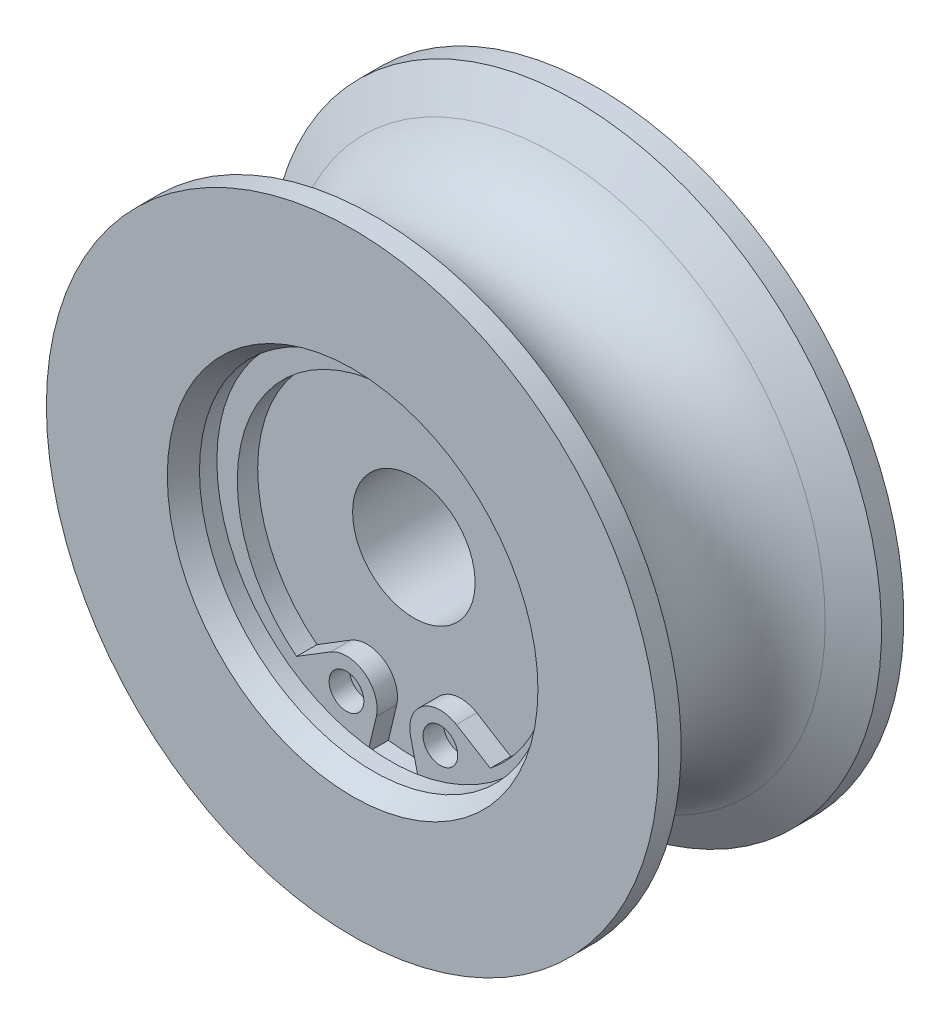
ISO-10303-21;
HEADER;
FILE_DESCRIPTION(('STEP AP214'),'2;1');
FILE_NAME('part.step','',(''),(''),'','','');
FILE_SCHEMA(('AUTOMOTIVE_DESIGN { 1 0 10303 214 1 1 1 1 }'));
ENDSEC;
DATA;
#1=APPLICATION_CONTEXT('core data for automotive mechanical design processes');
#2=APPLICATION_PROTOCOL_DEFINITION('international standard','automotive_design',2000,#1);
#3=PRODUCT_CONTEXT('',#1,'mechanical');
#4=PRODUCT('Part','Part','',(#3));
#5=PRODUCT_RELATED_PRODUCT_CATEGORY('part','',(#4));
#6=PRODUCT_DEFINITION_FORMATION('','',#4);
#7=PRODUCT_DEFINITION_CONTEXT('part definition',#1,'design');
#8=PRODUCT_DEFINITION('design','',#6,#7);
#9=PRODUCT_DEFINITION_SHAPE('','',#8);
#10=(LENGTH_UNIT() NAMED_UNIT(*) SI_UNIT(.MILLI.,.METRE.));
#11=(NAMED_UNIT(*) PLANE_ANGLE_UNIT() SI_UNIT($,.RADIAN.));
#12=(NAMED_UNIT(*) SI_UNIT($,.STERADIAN.) SOLID_ANGLE_UNIT());
#13=UNCERTAINTY_MEASURE_WITH_UNIT(LENGTH_MEASURE(1.E-05),#10,'distance_accuracy_value','');
#14=(GEOMETRIC_REPRESENTATION_CONTEXT(3) GLOBAL_UNCERTAINTY_ASSIGNED_CONTEXT((#13)) GLOBAL_UNIT_ASSIGNED_CONTEXT((#10,
#11,#12)) REPRESENTATION_CONTEXT('',''));
#15=CARTESIAN_POINT('',(0.,0.,0.));
#16=DIRECTION('',(0.,0.,1.));
#17=DIRECTION('',(1.,0.,0.));
#18=AXIS2_PLACEMENT_3D('',#15,#16,#17);
#19=CARTESIAN_POINT('',(0.,-0.5,4.));
#20=DIRECTION('',(0.,0.,1.));
#21=DIRECTION('',(-1.,0.,0.));
#22=AXIS2_PLACEMENT_3D('',#19,#20,#21);
#23=CYLINDRICAL_SURFACE('',#22,7.65);
#24=CARTESIAN_POINT('',(0.,-0.5,3.));
#25=DIRECTION('',(0.,0.,1.));
#26=DIRECTION('',(1.,0.,0.));
#27=AXIS2_PLACEMENT_3D('',#24,#25,#26);
#28=CIRCLE('',#27,7.65);
#29=CARTESIAN_POINT('',(4.745138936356,-6.50051301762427,3.));
#30=VERTEX_POINT('',#29);
#31=CARTESIAN_POINT('',(-4.74513893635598,-6.50051301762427,3.));
#32=VERTEX_POINT('',#31);
#33=EDGE_CURVE('E180',#30,#32,#28,.T.);
#34=ORIENTED_EDGE('',*,*,#33,.F.);
#35=DIRECTION('',(0.,0.,-1.));
#36=VECTOR('',#35,1.);
#37=CARTESIAN_POINT('',(4.74513893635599,-6.50051301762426,4.));
#38=LINE('',#37,#36);
#39=CARTESIAN_POINT('',(4.74513893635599,-6.50051301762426,4.));
#40=VERTEX_POINT('',#39);
#41=EDGE_CURVE('E140',#40,#30,#38,.T.);
#42=ORIENTED_EDGE('',*,*,#41,.F.);
#43=CARTESIAN_POINT('',(0.,-0.5,4.));
#44=DIRECTION('',(0.,0.,-1.));
#45=DIRECTION('',(0.,-1.,0.));
#46=AXIS2_PLACEMENT_3D('',#43,#44,#45);
#47=CIRCLE('',#46,7.65);
#48=CARTESIAN_POINT('',(-4.74513893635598,-6.50051301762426,4.));
#49=VERTEX_POINT('',#48);
#50=EDGE_CURVE('E133',#49,#40,#47,.T.);
#51=ORIENTED_EDGE('',*,*,#50,.F.);
#52=DIRECTION('',(0.,0.,-1.));
#53=VECTOR('',#52,1.);
#54=CARTESIAN_POINT('',(-4.74513893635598,-6.50051301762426,4.));
#55=LINE('',#54,#53);
#56=EDGE_CURVE('E135',#49,#32,#55,.T.);
#57=ORIENTED_EDGE('',*,*,#56,.T.);
#58=EDGE_LOOP('',(#34,#42,#51,#57));
#59=FACE_BOUND('',#58,.T.);
#60=ADVANCED_FACE('F14',(#59),#23,.F.);
#61=CARTESIAN_POINT('',(3.08650226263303,-5.47917588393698,4.));
#62=DIRECTION('',(-0.524334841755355,-0.851512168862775,0.));
#63=DIRECTION('',(-0.851512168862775,0.524334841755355,0.));
#64=AXIS2_PLACEMENT_3D('',#61,#62,#63);
#65=PLANE('',#64);
#66=DIRECTION('',(0.851512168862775,-0.524334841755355,0.));
#67=VECTOR('',#66,1.);
#68=CARTESIAN_POINT('',(-2.93719834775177,-1.76996746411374,3.));
#69=LINE('',#68,#67);
#70=CARTESIAN_POINT('',(3.08650226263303,-5.47917588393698,3.));
#71=VERTEX_POINT('',#70);
#72=EDGE_CURVE('E104',#71,#30,#69,.T.);
#73=ORIENTED_EDGE('',*,*,#72,.F.);
#74=DIRECTION('',(0.,0.,-1.));
#75=VECTOR('',#74,1.);
#76=CARTESIAN_POINT('',(3.08650226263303,-5.47917588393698,4.));
#77=LINE('',#76,#75);
#78=CARTESIAN_POINT('',(3.08650226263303,-5.47917588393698,4.));
#79=VERTEX_POINT('',#78);
#80=EDGE_CURVE('E100',#79,#71,#77,.T.);
#81=ORIENTED_EDGE('',*,*,#80,.F.);
#82=DIRECTION('',(-0.851512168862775,0.524334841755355,0.));
#83=VECTOR('',#82,1.);
#84=CARTESIAN_POINT('',(3.08650226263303,-5.47917588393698,4.));
#85=LINE('',#84,#83);
#86=EDGE_CURVE('E129',#40,#79,#85,.T.);
#87=ORIENTED_EDGE('',*,*,#86,.F.);
#88=ORIENTED_EDGE('',*,*,#41,.T.);
#89=EDGE_LOOP('',(#73,#81,#87,#88));
#90=FACE_BOUND('',#89,.T.);
#91=ADVANCED_FACE('F176',(#90),#65,.F.);
#92=CARTESIAN_POINT('',(2.3,-6.75644413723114,4.));
#93=DIRECTION('',(0.,0.,1.));
#94=DIRECTION('',(-1.,0.,0.));
#95=AXIS2_PLACEMENT_3D('',#92,#93,#94);
#96=CYLINDRICAL_SURFACE('',#95,1.5);
#97=CARTESIAN_POINT('',(2.3,-6.75644413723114,3.));
#98=DIRECTION('',(0.,0.,1.));
#99=DIRECTION('',(1.,0.,0.));
#100=AXIS2_PLACEMENT_3D('',#97,#98,#99);
#101=CIRCLE('',#100,1.5);
#102=CARTESIAN_POINT('',(0.840693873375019,-7.10346809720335,3.));
#103=VERTEX_POINT('',#102);
#104=EDGE_CURVE('E96',#71,#103,#101,.T.);
#105=ORIENTED_EDGE('',*,*,#104,.T.);
#106=DIRECTION('',(0.,0.,-1.));
#107=VECTOR('',#106,1.);
#108=CARTESIAN_POINT('',(0.840693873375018,-7.10346809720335,4.));
#109=LINE('',#108,#107);
#110=CARTESIAN_POINT('',(0.840693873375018,-7.10346809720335,4.));
#111=VERTEX_POINT('',#110);
#112=EDGE_CURVE('E98',#111,#103,#109,.T.);
#113=ORIENTED_EDGE('',*,*,#112,.F.);
#114=CARTESIAN_POINT('',(2.3,-6.75644413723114,4.));
#115=DIRECTION('',(0.,0.,1.));
#116=DIRECTION('',(1.,0.,0.));
#117=AXIS2_PLACEMENT_3D('',#114,#115,#116);
#118=CIRCLE('',#117,1.5);
#119=EDGE_CURVE('E134',#79,#111,#118,.T.);
#120=ORIENTED_EDGE('',*,*,#119,.F.);
#121=ORIENTED_EDGE('',*,*,#80,.T.);
#122=EDGE_LOOP('',(#105,#113,#120,#121));
#123=FACE_BOUND('',#122,.T.);
#124=ADVANCED_FACE('F16',(#123),#96,.T.);
#125=CARTESIAN_POINT('',(-0.84069387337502,-7.10346809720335,4.));
#126=DIRECTION('',(-0.97287075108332,0.231349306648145,0.));
#127=DIRECTION('',(0.,0.,1.));
#128=AXIS2_PLACEMENT_3D('',#125,#126,#127);
#129=PLANE('',#128);
#130=DIRECTION('',(0.,0.,-1.));
#131=VECTOR('',#130,1.);
#132=CARTESIAN_POINT('',(-1.24703201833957,-8.81220240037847,-6.));
#133=LINE('',#132,#131);
#134=CARTESIAN_POINT('',(-1.24703201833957,-8.81220240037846,3.));
#135=VERTEX_POINT('',#134);
#136=CARTESIAN_POINT('',(-1.24703201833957,-8.81220240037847,4.));
#137=VERTEX_POINT('',#136);
#138=EDGE_CURVE('E110',#135,#137,#133,.F.);
#139=ORIENTED_EDGE('',*,*,#138,.F.);
#140=DIRECTION('',(-0.231349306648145,-0.97287075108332,0.));
#141=VECTOR('',#140,1.);
#142=CARTESIAN_POINT('',(1.4783197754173,2.64845458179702,3.));
#143=LINE('',#142,#141);
#144=CARTESIAN_POINT('',(-0.840693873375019,-7.10346809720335,3.));
#145=VERTEX_POINT('',#144);
#146=EDGE_CURVE('E189',#145,#135,#143,.T.);
#147=ORIENTED_EDGE('',*,*,#146,.F.);
#148=DIRECTION('',(0.,0.,-1.));
#149=VECTOR('',#148,1.);
#150=CARTESIAN_POINT('',(-0.84069387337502,-7.10346809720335,4.));
#151=LINE('',#150,#149);
#152=CARTESIAN_POINT('',(-0.84069387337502,-7.10346809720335,4.));
#153=VERTEX_POINT('',#152);
#154=EDGE_CURVE('E117',#153,#145,#151,.T.);
#155=ORIENTED_EDGE('',*,*,#154,.F.);
#156=DIRECTION('',(0.231349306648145,0.97287075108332,0.));
#157=VECTOR('',#156,1.);
#158=CARTESIAN_POINT('',(-0.84069387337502,-7.10346809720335,4.));
#159=LINE('',#158,#157);
#160=EDGE_CURVE('E157',#137,#153,#159,.T.);
#161=ORIENTED_EDGE('',*,*,#160,.F.);
#162=EDGE_LOOP('',(#139,#147,#155,#161));
#163=FACE_BOUND('',#162,.T.);
#164=ADVANCED_FACE('F296',(#163),#129,.F.);
#165=CARTESIAN_POINT('',(0.,-0.5,4.));
#166=DIRECTION('',(0.,0.,-1.));
#167=DIRECTION('',(0.,-1.,0.));
#168=AXIS2_PLACEMENT_3D('',#165,#166,#167);
#169=PLANE('',#168);
#170=CARTESIAN_POINT('',(2.3,-6.75644413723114,4.));
#171=DIRECTION('',(0.,0.,1.));
#172=DIRECTION('',(1.,0.,0.));
#173=AXIS2_PLACEMENT_3D('',#170,#171,#172);
#174=CIRCLE('',#173,0.85);
#175=CARTESIAN_POINT('',(3.15,-6.75644413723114,4.));
#176=VERTEX_POINT('',#175);
#177=EDGE_CURVE('E125',#176,#176,#174,.T.);
#178=ORIENTED_EDGE('',*,*,#177,.F.);
#179=EDGE_LOOP('',(#178));
#180=FACE_BOUND('',#179,.T.);
#181=CARTESIAN_POINT('',(-2.3,-6.75644413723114,4.));
#182=DIRECTION('',(0.,0.,-1.));
#183=DIRECTION('',(1.,0.,0.));
#184=AXIS2_PLACEMENT_3D('',#181,#182,#183);
#185=CIRCLE('',#184,0.85);
#186=CARTESIAN_POINT('',(-1.45,-6.75644413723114,4.));
#187=VERTEX_POINT('',#186);
#188=EDGE_CURVE('E122',#187,#187,#185,.T.);
#189=ORIENTED_EDGE('',*,*,#188,.T.);
#190=EDGE_LOOP('',(#189));
#191=FACE_BOUND('',#190,.T.);
#192=CARTESIAN_POINT('',(0.,0.,4.));
#193=DIRECTION('',(0.,0.,-1.));
#194=DIRECTION('',(-1.,0.,0.));
#195=AXIS2_PLACEMENT_3D('',#192,#193,#194);
#196=CIRCLE('',#195,8.9);
#197=CARTESIAN_POINT('',(1.24703201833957,-8.81220240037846,4.));
#198=VERTEX_POINT('',#197);
#199=EDGE_CURVE('E23',#137,#198,#196,.T.);
#200=ORIENTED_EDGE('',*,*,#199,.F.);
#201=ORIENTED_EDGE('',*,*,#160,.T.);
#202=CARTESIAN_POINT('',(-2.3,-6.75644413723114,4.));
#203=DIRECTION('',(0.,0.,1.));
#204=DIRECTION('',(-1.,0.,0.));
#205=AXIS2_PLACEMENT_3D('',#202,#203,#204);
#206=CIRCLE('',#205,1.5);
#207=CARTESIAN_POINT('',(-3.08650226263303,-5.47917588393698,4.));
#208=VERTEX_POINT('',#207);
#209=EDGE_CURVE('E146',#153,#208,#206,.T.);
#210=ORIENTED_EDGE('',*,*,#209,.T.);
#211=DIRECTION('',(-0.851512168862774,-0.524334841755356,0.));
#212=VECTOR('',#211,1.);
#213=CARTESIAN_POINT('',(-3.08650226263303,-5.47917588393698,4.));
#214=LINE('',#213,#212);
#215=EDGE_CURVE('E59',#208,#49,#214,.T.);
#216=ORIENTED_EDGE('',*,*,#215,.T.);
#217=ORIENTED_EDGE('',*,*,#50,.T.);
#218=ORIENTED_EDGE('',*,*,#86,.T.);
#219=ORIENTED_EDGE('',*,*,#119,.T.);
#220=DIRECTION('',(0.231349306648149,-0.972870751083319,0.));
#221=VECTOR('',#220,1.);
#222=CARTESIAN_POINT('',(0.840693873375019,-7.10346809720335,4.));
#223=LINE('',#222,#221);
#224=EDGE_CURVE('E114',#111,#198,#223,.T.);
#225=ORIENTED_EDGE('',*,*,#224,.T.);
#226=EDGE_LOOP('',(#200,#201,#210,#216,#217,#218,#219,#225));
#227=FACE_BOUND('',#226,.T.);
#228=ADVANCED_FACE('F171',(#180,#191,#227),#169,.F.);
#229=CARTESIAN_POINT('',(2.3,-6.75644413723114,4.));
#230=DIRECTION('',(0.,0.,1.));
#231=DIRECTION('',(-1.,0.,0.));
#232=AXIS2_PLACEMENT_3D('',#229,#230,#231);
#233=CYLINDRICAL_SURFACE('',#232,0.85);
#234=CARTESIAN_POINT('',(2.3,-6.75644413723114,3.));
#235=DIRECTION('',(0.,0.,1.));
#236=DIRECTION('',(1.,0.,0.));
#237=AXIS2_PLACEMENT_3D('',#234,#235,#236);
#238=CIRCLE('',#237,0.85);
#239=CARTESIAN_POINT('',(3.15,-6.75644413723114,3.));
#240=VERTEX_POINT('',#239);
#241=EDGE_CURVE('E199',#240,#240,#238,.T.);
#242=ORIENTED_EDGE('',*,*,#241,.F.);
#243=EDGE_LOOP('',(#242));
#244=FACE_BOUND('',#243,.T.);
#245=ORIENTED_EDGE('',*,*,#177,.T.);
#246=EDGE_LOOP('',(#245));
#247=FACE_BOUND('',#246,.T.);
#248=ADVANCED_FACE('F295',(#244,#247),#233,.F.);
#249=CARTESIAN_POINT('',(-2.3,-6.75644413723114,4.));
#250=DIRECTION('',(0.,0.,1.));
#251=DIRECTION('',(-1.,0.,0.));
#252=AXIS2_PLACEMENT_3D('',#249,#250,#251);
#253=CYLINDRICAL_SURFACE('',#252,0.85);
#254=CARTESIAN_POINT('',(-2.3,-6.75644413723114,3.));
#255=DIRECTION('',(0.,0.,1.));
#256=DIRECTION('',(1.,0.,0.));
#257=AXIS2_PLACEMENT_3D('',#254,#255,#256);
#258=CIRCLE('',#257,0.85);
#259=CARTESIAN_POINT('',(-1.45,-6.75644413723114,3.));
#260=VERTEX_POINT('',#259);
#261=EDGE_CURVE('E195',#260,#260,#258,.T.);
#262=ORIENTED_EDGE('',*,*,#261,.F.);
#263=EDGE_LOOP('',(#262));
#264=FACE_BOUND('',#263,.T.);
#265=ORIENTED_EDGE('',*,*,#188,.F.);
#266=EDGE_LOOP('',(#265));
#267=FACE_BOUND('',#266,.T.);
#268=ADVANCED_FACE('F302',(#264,#267),#253,.F.);
#269=CARTESIAN_POINT('',(-3.08650226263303,-5.47917588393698,4.));
#270=DIRECTION('',(0.524334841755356,-0.851512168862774,0.));
#271=DIRECTION('',(0.,0.,-1.));
#272=AXIS2_PLACEMENT_3D('',#269,#270,#271);
#273=PLANE('',#272);
#274=DIRECTION('',(0.851512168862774,0.524334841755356,0.));
#275=VECTOR('',#274,1.);
#276=CARTESIAN_POINT('',(2.93719834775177,-1.76996746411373,3.));
#277=LINE('',#276,#275);
#278=CARTESIAN_POINT('',(-3.08650226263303,-5.47917588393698,3.));
#279=VERTEX_POINT('',#278);
#280=EDGE_CURVE('E184',#32,#279,#277,.T.);
#281=ORIENTED_EDGE('',*,*,#280,.F.);
#282=ORIENTED_EDGE('',*,*,#56,.F.);
#283=ORIENTED_EDGE('',*,*,#215,.F.);
#284=DIRECTION('',(0.,0.,-1.));
#285=VECTOR('',#284,1.);
#286=CARTESIAN_POINT('',(-3.08650226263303,-5.47917588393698,4.));
#287=LINE('',#286,#285);
#288=EDGE_CURVE('E139',#208,#279,#287,.T.);
#289=ORIENTED_EDGE('',*,*,#288,.T.);
#290=EDGE_LOOP('',(#281,#282,#283,#289));
#291=FACE_BOUND('',#290,.T.);
#292=ADVANCED_FACE('F292',(#291),#273,.F.);
#293=CARTESIAN_POINT('',(-2.3,-6.75644413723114,4.));
#294=DIRECTION('',(0.,0.,1.));
#295=DIRECTION('',(-1.,0.,0.));
#296=AXIS2_PLACEMENT_3D('',#293,#294,#295);
#297=CYLINDRICAL_SURFACE('',#296,1.5);
#298=CARTESIAN_POINT('',(-2.3,-6.75644413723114,3.));
#299=DIRECTION('',(0.,0.,1.));
#300=DIRECTION('',(1.,0.,0.));
#301=AXIS2_PLACEMENT_3D('',#298,#299,#300);
#302=CIRCLE('',#301,1.5);
#303=EDGE_CURVE('E191',#145,#279,#302,.T.);
#304=ORIENTED_EDGE('',*,*,#303,.T.);
#305=ORIENTED_EDGE('',*,*,#288,.F.);
#306=ORIENTED_EDGE('',*,*,#209,.F.);
#307=ORIENTED_EDGE('',*,*,#154,.T.);
#308=EDGE_LOOP('',(#304,#305,#306,#307));
#309=FACE_BOUND('',#308,.T.);
#310=ADVANCED_FACE('F278',(#309),#297,.T.);
#311=CARTESIAN_POINT('',(0.840693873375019,-7.10346809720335,4.));
#312=DIRECTION('',(0.972870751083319,0.231349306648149,0.));
#313=DIRECTION('',(0.,0.,-1.));
#314=AXIS2_PLACEMENT_3D('',#311,#312,#313);
#315=PLANE('',#314);
#316=DIRECTION('',(0.,0.,-1.));
#317=VECTOR('',#316,1.);
#318=CARTESIAN_POINT('',(1.24703201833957,-8.81220240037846,-6.));
#319=LINE('',#318,#317);
#320=CARTESIAN_POINT('',(1.24703201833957,-8.81220240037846,3.));
#321=VERTEX_POINT('',#320);
#322=EDGE_CURVE('E9',#198,#321,#319,.T.);
#323=ORIENTED_EDGE('',*,*,#322,.F.);
#324=ORIENTED_EDGE('',*,*,#224,.F.);
#325=ORIENTED_EDGE('',*,*,#112,.T.);
#326=DIRECTION('',(-0.231349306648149,0.972870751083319,0.));
#327=VECTOR('',#326,1.);
#328=CARTESIAN_POINT('',(-1.47831977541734,2.648454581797,3.));
#329=LINE('',#328,#327);
#330=EDGE_CURVE('E65',#321,#103,#329,.T.);
#331=ORIENTED_EDGE('',*,*,#330,.F.);
#332=EDGE_LOOP('',(#323,#324,#325,#331));
#333=FACE_BOUND('',#332,.T.);
#334=ADVANCED_FACE('F112',(#333),#315,.F.);
#335=CARTESIAN_POINT('',(0.,3.,3.));
#336=DIRECTION('',(0.,0.,1.));
#337=DIRECTION('',(1.,0.,0.));
#338=AXIS2_PLACEMENT_3D('',#335,#336,#337);
#339=PLANE('',#338);
#340=ORIENTED_EDGE('',*,*,#241,.T.);
#341=EDGE_LOOP('',(#340));
#342=FACE_BOUND('',#341,.T.);
#343=ADVANCED_FACE('F267',(#342),#339,.T.);
#344=ORIENTED_EDGE('',*,*,#261,.T.);
#345=EDGE_LOOP('',(#344));
#346=FACE_BOUND('',#345,.T.);
#347=ADVANCED_FACE('F269',(#346),#339,.T.);
#348=CARTESIAN_POINT('',(0.,0.,0.));
#349=DIRECTION('',(0.,0.,-1.));
#350=DIRECTION('',(-1.,0.,0.));
#351=AXIS2_PLACEMENT_3D('',#348,#349,#350);
#352=TOROIDAL_SURFACE('',#351,15.5,4.5);
#353=CARTESIAN_POINT('',(0.,0.,3.89711431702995));
#354=DIRECTION('',(0.,0.,-1.));
#355=DIRECTION('',(-1.,0.,0.));
#356=AXIS2_PLACEMENT_3D('',#353,#354,#355);
#357=CIRCLE('',#356,13.25);
#358=CARTESIAN_POINT('',(-13.25,0.,3.89711431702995));
#359=VERTEX_POINT('',#358);
#360=EDGE_CURVE('E209',#359,#359,#357,.T.);
#361=ORIENTED_EDGE('',*,*,#360,.T.);
#362=EDGE_LOOP('',(#361));
#363=FACE_BOUND('',#362,.T.);
#364=CARTESIAN_POINT('',(0.,0.,-3.89711431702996));
#365=DIRECTION('',(0.,0.,-1.));
#366=DIRECTION('',(-1.,0.,0.));
#367=AXIS2_PLACEMENT_3D('',#364,#365,#366);
#368=CIRCLE('',#367,13.25);
#369=CARTESIAN_POINT('',(-13.25,0.,-3.89711431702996));
#370=VERTEX_POINT('',#369);
#371=EDGE_CURVE('E206',#370,#370,#368,.T.);
#372=ORIENTED_EDGE('',*,*,#371,.F.);
#373=EDGE_LOOP('',(#372));
#374=FACE_BOUND('',#373,.T.);
#375=ADVANCED_FACE('F276',(#363,#374),#352,.F.);
#376=CARTESIAN_POINT('',(0.,0.,3.89711431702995));
#377=DIRECTION('',(0.,0.,1.));
#378=DIRECTION('',(1.,0.,0.));
#379=AXIS2_PLACEMENT_3D('',#376,#377,#378);
#380=CONICAL_SURFACE('',#379,13.25,1.04719755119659);
#381=CARTESIAN_POINT('',(0.,0.,4.90747728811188));
#382=DIRECTION('',(0.,0.,-1.));
#383=DIRECTION('',(-1.,0.,0.));
#384=AXIS2_PLACEMENT_3D('',#381,#382,#383);
#385=CIRCLE('',#384,15.);
#386=CARTESIAN_POINT('',(-15.,0.,4.90747728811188));
#387=VERTEX_POINT('',#386);
#388=EDGE_CURVE('E212',#387,#387,#385,.T.);
#389=ORIENTED_EDGE('',*,*,#388,.T.);
#390=EDGE_LOOP('',(#389));
#391=FACE_BOUND('',#390,.T.);
#392=ORIENTED_EDGE('',*,*,#360,.F.);
#393=EDGE_LOOP('',(#392));
#394=FACE_BOUND('',#393,.T.);
#395=ADVANCED_FACE('F364',(#391,#394),#380,.T.);
#396=CARTESIAN_POINT('',(0.,0.,-4.90747728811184));
#397=DIRECTION('',(0.,0.,-1.));
#398=DIRECTION('',(-1.,0.,0.));
#399=AXIS2_PLACEMENT_3D('',#396,#397,#398);
#400=CONICAL_SURFACE('',#399,15.,1.04719755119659);
#401=ORIENTED_EDGE('',*,*,#371,.T.);
#402=EDGE_LOOP('',(#401));
#403=FACE_BOUND('',#402,.T.);
#404=CARTESIAN_POINT('',(0.,0.,-4.90747728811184));
#405=DIRECTION('',(0.,0.,-1.));
#406=DIRECTION('',(-1.,0.,0.));
#407=AXIS2_PLACEMENT_3D('',#404,#405,#406);
#408=CIRCLE('',#407,15.);
#409=CARTESIAN_POINT('',(-15.,0.,-4.90747728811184));
#410=VERTEX_POINT('',#409);
#411=EDGE_CURVE('E203',#410,#410,#408,.T.);
#412=ORIENTED_EDGE('',*,*,#411,.F.);
#413=EDGE_LOOP('',(#412));
#414=FACE_BOUND('',#413,.T.);
#415=ADVANCED_FACE('F262',(#403,#414),#400,.T.);
#416=CARTESIAN_POINT('',(0.,0.,-6.));
#417=DIRECTION('',(0.,0.,-1.));
#418=DIRECTION('',(-1.,0.,0.));
#419=AXIS2_PLACEMENT_3D('',#416,#417,#418);
#420=CYLINDRICAL_SURFACE('',#419,15.);
#421=CARTESIAN_POINT('',(0.,0.,6.));
#422=DIRECTION('',(0.,0.,-1.));
#423=DIRECTION('',(-1.,0.,0.));
#424=AXIS2_PLACEMENT_3D('',#421,#422,#423);
#425=CIRCLE('',#424,15.);
#426=CARTESIAN_POINT('',(-15.,0.,6.));
#427=VERTEX_POINT('',#426);
#428=EDGE_CURVE('E215',#427,#427,#425,.T.);
#429=ORIENTED_EDGE('',*,*,#428,.T.);
#430=EDGE_LOOP('',(#429));
#431=FACE_BOUND('',#430,.T.);
#432=ORIENTED_EDGE('',*,*,#388,.F.);
#433=EDGE_LOOP('',(#432));
#434=FACE_BOUND('',#433,.T.);
#435=ADVANCED_FACE('F252',(#431,#434),#420,.T.);
#436=CARTESIAN_POINT('',(0.,0.,-6.));
#437=DIRECTION('',(0.,0.,-1.));
#438=DIRECTION('',(-1.,0.,0.));
#439=AXIS2_PLACEMENT_3D('',#436,#437,#438);
#440=CYLINDRICAL_SURFACE('',#439,15.);
#441=ORIENTED_EDGE('',*,*,#411,.T.);
#442=EDGE_LOOP('',(#441));
#443=FACE_BOUND('',#442,.T.);
#444=CARTESIAN_POINT('',(0.,0.,-6.));
#445=DIRECTION('',(0.,0.,-1.));
#446=DIRECTION('',(-1.,0.,0.));
#447=AXIS2_PLACEMENT_3D('',#444,#445,#446);
#448=CIRCLE('',#447,15.);
#449=CARTESIAN_POINT('',(-15.,0.,-6.));
#450=VERTEX_POINT('',#449);
#451=EDGE_CURVE('E151',#450,#450,#448,.T.);
#452=ORIENTED_EDGE('',*,*,#451,.F.);
#453=EDGE_LOOP('',(#452));
#454=FACE_BOUND('',#453,.T.);
#455=ADVANCED_FACE('F249',(#443,#454),#440,.T.);
#456=CARTESIAN_POINT('',(0.,15.,6.));
#457=DIRECTION('',(0.,0.,1.));
#458=DIRECTION('',(1.,0.,0.));
#459=AXIS2_PLACEMENT_3D('',#456,#457,#458);
#460=PLANE('',#459);
#461=CARTESIAN_POINT('',(0.,0.,6.));
#462=DIRECTION('',(0.,0.,-1.));
#463=DIRECTION('',(-1.,0.,0.));
#464=AXIS2_PLACEMENT_3D('',#461,#462,#463);
#465=CIRCLE('',#464,9.07735026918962);
#466=CARTESIAN_POINT('',(-9.07735026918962,0.,6.));
#467=VERTEX_POINT('',#466);
#468=EDGE_CURVE('E218',#467,#467,#465,.T.);
#469=ORIENTED_EDGE('',*,*,#468,.T.);
#470=EDGE_LOOP('',(#469));
#471=FACE_BOUND('',#470,.T.);
#472=ORIENTED_EDGE('',*,*,#428,.F.);
#473=EDGE_LOOP('',(#472));
#474=FACE_BOUND('',#473,.T.);
#475=ADVANCED_FACE('F251',(#471,#474),#460,.T.);
#476=CARTESIAN_POINT('',(0.,6.5,-6.));
#477=DIRECTION('',(0.,0.,-1.));
#478=DIRECTION('',(-1.,0.,0.));
#479=AXIS2_PLACEMENT_3D('',#476,#477,#478);
#480=PLANE('',#479);
#481=ORIENTED_EDGE('',*,*,#451,.T.);
#482=EDGE_LOOP('',(#481));
#483=FACE_BOUND('',#482,.T.);
#484=CARTESIAN_POINT('',(0.,0.,-6.));
#485=DIRECTION('',(0.,0.,-1.));
#486=DIRECTION('',(-1.,0.,0.));
#487=AXIS2_PLACEMENT_3D('',#484,#485,#486);
#488=CIRCLE('',#487,6.5);
#489=CARTESIAN_POINT('',(-6.5,0.,-6.));
#490=VERTEX_POINT('',#489);
#491=EDGE_CURVE('E240',#490,#490,#488,.T.);
#492=ORIENTED_EDGE('',*,*,#491,.F.);
#493=EDGE_LOOP('',(#492));
#494=FACE_BOUND('',#493,.T.);
#495=ADVANCED_FACE('F246',(#483,#494),#480,.T.);
#496=CARTESIAN_POINT('',(0.,0.,6.));
#497=DIRECTION('',(0.,0.,1.));
#498=DIRECTION('',(1.,0.,0.));
#499=AXIS2_PLACEMENT_3D('',#496,#497,#498);
#500=CONICAL_SURFACE('',#499,9.07735026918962,0.523598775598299);
#501=CARTESIAN_POINT('',(0.,0.,5.));
#502=DIRECTION('',(0.,0.,-1.));
#503=DIRECTION('',(-1.,0.,0.));
#504=AXIS2_PLACEMENT_3D('',#501,#502,#503);
#505=CIRCLE('',#504,8.5);
#506=CARTESIAN_POINT('',(-8.5,0.,5.));
#507=VERTEX_POINT('',#506);
#508=EDGE_CURVE('E221',#507,#507,#505,.T.);
#509=ORIENTED_EDGE('',*,*,#508,.T.);
#510=EDGE_LOOP('',(#509));
#511=FACE_BOUND('',#510,.T.);
#512=ORIENTED_EDGE('',*,*,#468,.F.);
#513=EDGE_LOOP('',(#512));
#514=FACE_BOUND('',#513,.T.);
#515=ADVANCED_FACE('F407',(#511,#514),#500,.F.);
#516=CARTESIAN_POINT('',(0.,0.,-6.));
#517=DIRECTION('',(0.,0.,-1.));
#518=DIRECTION('',(-1.,0.,0.));
#519=AXIS2_PLACEMENT_3D('',#516,#517,#518);
#520=CYLINDRICAL_SURFACE('',#519,6.5);
#521=ORIENTED_EDGE('',*,*,#491,.T.);
#522=EDGE_LOOP('',(#521));
#523=FACE_BOUND('',#522,.T.);
#524=CARTESIAN_POINT('',(0.,0.,-3.));
#525=DIRECTION('',(0.,0.,-1.));
#526=DIRECTION('',(-1.,0.,0.));
#527=AXIS2_PLACEMENT_3D('',#524,#525,#526);
#528=CIRCLE('',#527,6.5);
#529=CARTESIAN_POINT('',(-6.5,0.,-3.));
#530=VERTEX_POINT('',#529);
#531=EDGE_CURVE('E237',#530,#530,#528,.T.);
#532=ORIENTED_EDGE('',*,*,#531,.F.);
#533=EDGE_LOOP('',(#532));
#534=FACE_BOUND('',#533,.T.);
#535=ADVANCED_FACE('F417',(#523,#534),#520,.F.);
#536=CARTESIAN_POINT('',(0.,0.,-6.));
#537=DIRECTION('',(0.,0.,-1.));
#538=DIRECTION('',(-1.,0.,0.));
#539=AXIS2_PLACEMENT_3D('',#536,#537,#538);
#540=CYLINDRICAL_SURFACE('',#539,8.5);
#541=CARTESIAN_POINT('',(0.,0.,4.15));
#542=DIRECTION('',(0.,0.,-1.));
#543=DIRECTION('',(-1.,0.,0.));
#544=AXIS2_PLACEMENT_3D('',#541,#542,#543);
#545=CIRCLE('',#544,8.5);
#546=CARTESIAN_POINT('',(-8.5,0.,4.15));
#547=VERTEX_POINT('',#546);
#548=EDGE_CURVE('E224',#547,#547,#545,.T.);
#549=ORIENTED_EDGE('',*,*,#548,.T.);
#550=EDGE_LOOP('',(#549));
#551=FACE_BOUND('',#550,.T.);
#552=ORIENTED_EDGE('',*,*,#508,.F.);
#553=EDGE_LOOP('',(#552));
#554=FACE_BOUND('',#553,.T.);
#555=ADVANCED_FACE('F427',(#551,#554),#540,.F.);
#556=CARTESIAN_POINT('',(0.,6.5,-3.));
#557=DIRECTION('',(0.,0.,-1.));
#558=DIRECTION('',(-1.,0.,0.));
#559=AXIS2_PLACEMENT_3D('',#556,#557,#558);
#560=PLANE('',#559);
#561=ORIENTED_EDGE('',*,*,#531,.T.);
#562=EDGE_LOOP('',(#561));
#563=FACE_BOUND('',#562,.T.);
#564=CARTESIAN_POINT('',(0.,0.,-3.));
#565=DIRECTION('',(0.,0.,-1.));
#566=DIRECTION('',(-1.,0.,0.));
#567=AXIS2_PLACEMENT_3D('',#564,#565,#566);
#568=CIRCLE('',#567,3.);
#569=CARTESIAN_POINT('',(-3.,0.,-3.));
#570=VERTEX_POINT('',#569);
#571=EDGE_CURVE('E234',#570,#570,#568,.T.);
#572=ORIENTED_EDGE('',*,*,#571,.F.);
#573=EDGE_LOOP('',(#572));
#574=FACE_BOUND('',#573,.T.);
#575=ADVANCED_FACE('F437',(#563,#574),#560,.T.);
#576=CARTESIAN_POINT('',(0.,8.9,4.15));
#577=DIRECTION('',(0.,0.,-1.));
#578=DIRECTION('',(-1.,0.,0.));
#579=AXIS2_PLACEMENT_3D('',#576,#577,#578);
#580=PLANE('',#579);
#581=CARTESIAN_POINT('',(0.,0.,4.15));
#582=DIRECTION('',(0.,0.,-1.));
#583=DIRECTION('',(-1.,0.,0.));
#584=AXIS2_PLACEMENT_3D('',#581,#582,#583);
#585=CIRCLE('',#584,8.9);
#586=CARTESIAN_POINT('',(-8.9,0.,4.15));
#587=VERTEX_POINT('',#586);
#588=EDGE_CURVE('E227',#587,#587,#585,.T.);
#589=ORIENTED_EDGE('',*,*,#588,.T.);
#590=EDGE_LOOP('',(#589));
#591=FACE_BOUND('',#590,.T.);
#592=ORIENTED_EDGE('',*,*,#548,.F.);
#593=EDGE_LOOP('',(#592));
#594=FACE_BOUND('',#593,.T.);
#595=ADVANCED_FACE('F447',(#591,#594),#580,.T.);
#596=CARTESIAN_POINT('',(0.,0.,-6.));
#597=DIRECTION('',(0.,0.,-1.));
#598=DIRECTION('',(-1.,0.,0.));
#599=AXIS2_PLACEMENT_3D('',#596,#597,#598);
#600=CYLINDRICAL_SURFACE('',#599,8.9);
#601=ORIENTED_EDGE('',*,*,#588,.F.);
#602=EDGE_LOOP('',(#601));
#603=FACE_BOUND('',#602,.T.);
#604=ORIENTED_EDGE('',*,*,#199,.T.);
#605=ORIENTED_EDGE('',*,*,#322,.T.);
#606=CARTESIAN_POINT('',(0.,0.,3.));
#607=DIRECTION('',(0.,0.,-1.));
#608=DIRECTION('',(-1.,0.,0.));
#609=AXIS2_PLACEMENT_3D('',#606,#607,#608);
#610=CIRCLE('',#609,8.9);
#611=EDGE_CURVE('E109',#321,#135,#610,.T.);
#612=ORIENTED_EDGE('',*,*,#611,.T.);
#613=ORIENTED_EDGE('',*,*,#138,.T.);
#614=EDGE_LOOP('',(#604,#605,#612,#613));
#615=FACE_BOUND('',#614,.T.);
#616=ADVANCED_FACE('F169',(#603,#615),#600,.F.);
#617=CARTESIAN_POINT('',(0.,0.,-6.));
#618=DIRECTION('',(0.,0.,-1.));
#619=DIRECTION('',(-1.,0.,0.));
#620=AXIS2_PLACEMENT_3D('',#617,#618,#619);
#621=CYLINDRICAL_SURFACE('',#620,3.);
#622=ORIENTED_EDGE('',*,*,#571,.T.);
#623=EDGE_LOOP('',(#622));
#624=FACE_BOUND('',#623,.T.);
#625=CARTESIAN_POINT('',(0.,0.,3.));
#626=DIRECTION('',(0.,0.,-1.));
#627=DIRECTION('',(-1.,0.,0.));
#628=AXIS2_PLACEMENT_3D('',#625,#626,#627);
#629=CIRCLE('',#628,3.);
#630=CARTESIAN_POINT('',(-3.,0.,3.));
#631=VERTEX_POINT('',#630);
#632=EDGE_CURVE('E231',#631,#631,#629,.T.);
#633=ORIENTED_EDGE('',*,*,#632,.F.);
#634=EDGE_LOOP('',(#633));
#635=FACE_BOUND('',#634,.T.);
#636=ADVANCED_FACE('F282',(#624,#635),#621,.F.);
#637=ORIENTED_EDGE('',*,*,#632,.T.);
#638=EDGE_LOOP('',(#637));
#639=FACE_BOUND('',#638,.T.);
#640=ORIENTED_EDGE('',*,*,#611,.F.);
#641=ORIENTED_EDGE('',*,*,#330,.T.);
#642=ORIENTED_EDGE('',*,*,#104,.F.);
#643=ORIENTED_EDGE('',*,*,#72,.T.);
#644=ORIENTED_EDGE('',*,*,#33,.T.);
#645=ORIENTED_EDGE('',*,*,#280,.T.);
#646=ORIENTED_EDGE('',*,*,#303,.F.);
#647=ORIENTED_EDGE('',*,*,#146,.T.);
#648=EDGE_LOOP('',(#640,#641,#642,#643,#644,#645,#646,#647));
#649=FACE_BOUND('',#648,.T.);
#650=ADVANCED_FACE('F107',(#639,#649),#339,.T.);
#651=CLOSED_SHELL('',(#60,#91,#124,#164,#228,#248,#268,#292,#310,#334,#343,#347,#375,#395,#415,
#435,#455,#475,#495,#515,#535,#555,#575,#595,#616,#636,#650));
#652=MANIFOLD_SOLID_BREP('B1',#651);
#653=ADVANCED_BREP_SHAPE_REPRESENTATION('',(#18,#652),#14);
#654=SHAPE_DEFINITION_REPRESENTATION(#9,#653);
ENDSEC;
END-ISO-10303-21;
